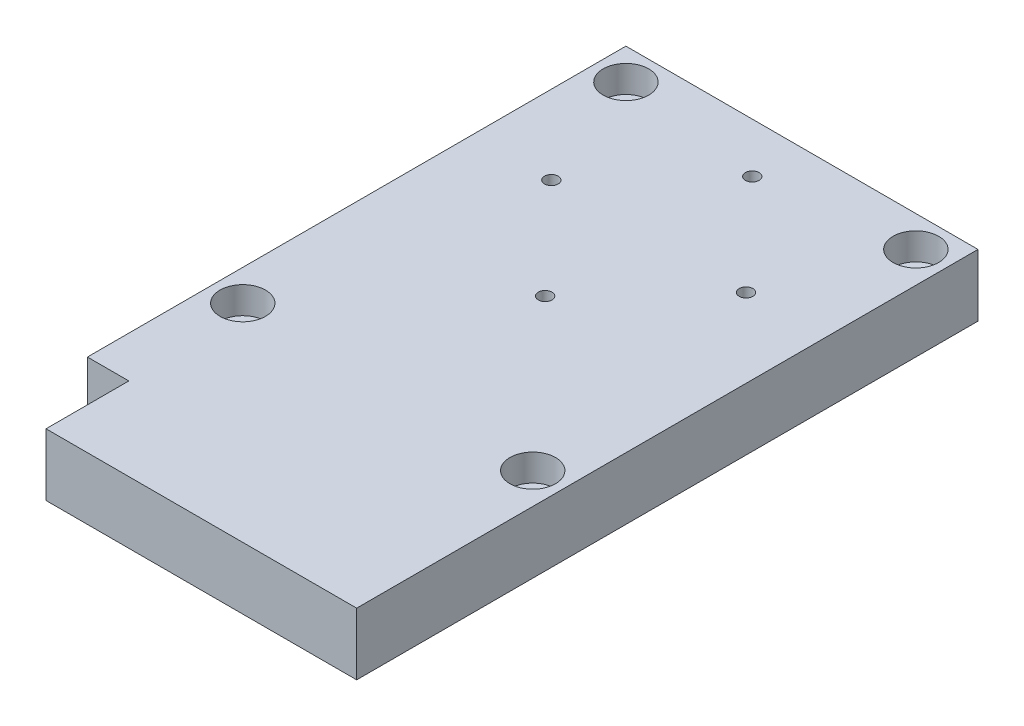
ISO-10303-21;
HEADER;
FILE_DESCRIPTION(('STEP AP214'),'2;1');
FILE_NAME('part.step','',(''),(''),'','','');
FILE_SCHEMA(('AUTOMOTIVE_DESIGN { 1 0 10303 214 1 1 1 1 }'));
ENDSEC;
DATA;
#1=APPLICATION_CONTEXT('core data for automotive mechanical design processes');
#2=APPLICATION_PROTOCOL_DEFINITION('international standard','automotive_design',2000,#1);
#3=PRODUCT_CONTEXT('',#1,'mechanical');
#4=PRODUCT('Part','Part','',(#3));
#5=PRODUCT_RELATED_PRODUCT_CATEGORY('part','',(#4));
#6=PRODUCT_DEFINITION_FORMATION('','',#4);
#7=PRODUCT_DEFINITION_CONTEXT('part definition',#1,'design');
#8=PRODUCT_DEFINITION('design','',#6,#7);
#9=PRODUCT_DEFINITION_SHAPE('','',#8);
#10=(LENGTH_UNIT() NAMED_UNIT(*) SI_UNIT(.MILLI.,.METRE.));
#11=(NAMED_UNIT(*) PLANE_ANGLE_UNIT() SI_UNIT($,.RADIAN.));
#12=(NAMED_UNIT(*) SI_UNIT($,.STERADIAN.) SOLID_ANGLE_UNIT());
#13=UNCERTAINTY_MEASURE_WITH_UNIT(LENGTH_MEASURE(1.E-05),#10,'distance_accuracy_value','');
#14=(GEOMETRIC_REPRESENTATION_CONTEXT(3) GLOBAL_UNCERTAINTY_ASSIGNED_CONTEXT((#13)) GLOBAL_UNIT_ASSIGNED_CONTEXT((#10,
#11,#12)) REPRESENTATION_CONTEXT('',''));
#15=CARTESIAN_POINT('',(0.,0.,0.));
#16=DIRECTION('',(0.,0.,1.));
#17=DIRECTION('',(1.,0.,0.));
#18=AXIS2_PLACEMENT_3D('',#15,#16,#17);
#19=CARTESIAN_POINT('',(7.5,-135.,100.));
#20=DIRECTION('',(0.,1.,0.));
#21=DIRECTION('',(0.,0.,1.));
#22=AXIS2_PLACEMENT_3D('',#19,#20,#21);
#23=CYLINDRICAL_SURFACE('',#22,3.25);
#24=CARTESIAN_POINT('',(7.5,1.11022302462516E-13,100.));
#25=DIRECTION('',(0.,1.,0.));
#26=DIRECTION('',(0.,0.,1.));
#27=AXIS2_PLACEMENT_3D('',#24,#25,#26);
#28=CIRCLE('',#27,3.25);
#29=CARTESIAN_POINT('',(7.5,1.11022302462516E-13,103.25));
#30=VERTEX_POINT('',#29);
#31=EDGE_CURVE('E171',#30,#30,#28,.T.);
#32=ORIENTED_EDGE('',*,*,#31,.F.);
#33=EDGE_LOOP('',(#32));
#34=FACE_BOUND('',#33,.T.);
#35=CARTESIAN_POINT('',(7.5,8.50000000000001,100.));
#36=DIRECTION('',(0.,1.,0.));
#37=DIRECTION('',(0.,0.,1.));
#38=AXIS2_PLACEMENT_3D('',#35,#36,#37);
#39=CIRCLE('',#38,3.25);
#40=CARTESIAN_POINT('',(7.5,8.50000000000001,103.25));
#41=VERTEX_POINT('',#40);
#42=EDGE_CURVE('E36',#41,#41,#39,.F.);
#43=ORIENTED_EDGE('',*,*,#42,.F.);
#44=EDGE_LOOP('',(#43));
#45=FACE_BOUND('',#44,.T.);
#46=ADVANCED_FACE('F32',(#34,#45),#23,.F.);
#47=CARTESIAN_POINT('',(77.5,-135.,100.));
#48=DIRECTION('',(0.,1.,0.));
#49=DIRECTION('',(0.,0.,1.));
#50=AXIS2_PLACEMENT_3D('',#47,#48,#49);
#51=CYLINDRICAL_SURFACE('',#50,3.25);
#52=CARTESIAN_POINT('',(77.5,1.11022302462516E-13,100.));
#53=DIRECTION('',(0.,1.,0.));
#54=DIRECTION('',(0.,0.,1.));
#55=AXIS2_PLACEMENT_3D('',#52,#53,#54);
#56=CIRCLE('',#55,3.25);
#57=CARTESIAN_POINT('',(77.5,1.11022302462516E-13,103.25));
#58=VERTEX_POINT('',#57);
#59=EDGE_CURVE('E174',#58,#58,#56,.T.);
#60=ORIENTED_EDGE('',*,*,#59,.F.);
#61=EDGE_LOOP('',(#60));
#62=FACE_BOUND('',#61,.T.);
#63=CARTESIAN_POINT('',(77.5,8.50000000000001,100.));
#64=DIRECTION('',(0.,1.,0.));
#65=DIRECTION('',(0.,0.,1.));
#66=AXIS2_PLACEMENT_3D('',#63,#64,#65);
#67=CIRCLE('',#66,3.25);
#68=CARTESIAN_POINT('',(77.5,8.50000000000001,103.25));
#69=VERTEX_POINT('',#68);
#70=EDGE_CURVE('E123',#69,#69,#67,.F.);
#71=ORIENTED_EDGE('',*,*,#70,.F.);
#72=EDGE_LOOP('',(#71));
#73=FACE_BOUND('',#72,.T.);
#74=ADVANCED_FACE('F225',(#62,#73),#51,.F.);
#75=CARTESIAN_POINT('',(77.5,-135.,7.5));
#76=DIRECTION('',(0.,1.,0.));
#77=DIRECTION('',(0.,0.,1.));
#78=AXIS2_PLACEMENT_3D('',#75,#76,#77);
#79=CYLINDRICAL_SURFACE('',#78,3.25);
#80=CARTESIAN_POINT('',(77.5,1.11022302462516E-13,7.5));
#81=DIRECTION('',(0.,1.,0.));
#82=DIRECTION('',(0.,0.,1.));
#83=AXIS2_PLACEMENT_3D('',#80,#81,#82);
#84=CIRCLE('',#83,3.25);
#85=CARTESIAN_POINT('',(77.5,1.11022302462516E-13,10.75));
#86=VERTEX_POINT('',#85);
#87=EDGE_CURVE('E177',#86,#86,#84,.T.);
#88=ORIENTED_EDGE('',*,*,#87,.F.);
#89=EDGE_LOOP('',(#88));
#90=FACE_BOUND('',#89,.T.);
#91=CARTESIAN_POINT('',(77.5,8.50000000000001,7.5));
#92=DIRECTION('',(0.,1.,0.));
#93=DIRECTION('',(0.,0.,1.));
#94=AXIS2_PLACEMENT_3D('',#91,#92,#93);
#95=CIRCLE('',#94,3.25);
#96=CARTESIAN_POINT('',(77.5,8.50000000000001,10.75));
#97=VERTEX_POINT('',#96);
#98=EDGE_CURVE('E119',#97,#97,#95,.F.);
#99=ORIENTED_EDGE('',*,*,#98,.F.);
#100=EDGE_LOOP('',(#99));
#101=FACE_BOUND('',#100,.T.);
#102=ADVANCED_FACE('F231',(#90,#101),#79,.F.);
#103=CARTESIAN_POINT('',(7.5,-135.,7.5));
#104=DIRECTION('',(0.,1.,0.));
#105=DIRECTION('',(0.,0.,1.));
#106=AXIS2_PLACEMENT_3D('',#103,#104,#105);
#107=CYLINDRICAL_SURFACE('',#106,3.25);
#108=CARTESIAN_POINT('',(7.5,1.11022302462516E-13,7.5));
#109=DIRECTION('',(0.,1.,0.));
#110=DIRECTION('',(0.,0.,1.));
#111=AXIS2_PLACEMENT_3D('',#108,#109,#110);
#112=CIRCLE('',#111,3.25);
#113=CARTESIAN_POINT('',(7.5,1.11022302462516E-13,10.75));
#114=VERTEX_POINT('',#113);
#115=EDGE_CURVE('E180',#114,#114,#112,.T.);
#116=ORIENTED_EDGE('',*,*,#115,.F.);
#117=EDGE_LOOP('',(#116));
#118=FACE_BOUND('',#117,.T.);
#119=CARTESIAN_POINT('',(7.5,8.50000000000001,7.5));
#120=DIRECTION('',(0.,1.,0.));
#121=DIRECTION('',(0.,0.,1.));
#122=AXIS2_PLACEMENT_3D('',#119,#120,#121);
#123=CIRCLE('',#122,3.25);
#124=CARTESIAN_POINT('',(7.5,8.50000000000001,10.75));
#125=VERTEX_POINT('',#124);
#126=EDGE_CURVE('E114',#125,#125,#123,.F.);
#127=ORIENTED_EDGE('',*,*,#126,.F.);
#128=EDGE_LOOP('',(#127));
#129=FACE_BOUND('',#128,.T.);
#130=ADVANCED_FACE('F240',(#118,#129),#107,.F.);
#131=CARTESIAN_POINT('',(0.,1.13686837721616E-13,150.));
#132=DIRECTION('',(0.,1.,0.));
#133=DIRECTION('',(0.,0.,1.));
#134=AXIS2_PLACEMENT_3D('',#131,#132,#133);
#135=PLANE('',#134);
#136=CARTESIAN_POINT('',(42.5,1.11022302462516E-13,12.0000000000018));
#137=DIRECTION('',(0.,1.,0.));
#138=DIRECTION('',(0.,0.,1.));
#139=AXIS2_PLACEMENT_3D('',#136,#137,#138);
#140=CIRCLE('',#139,1.65);
#141=CARTESIAN_POINT('',(42.5,1.11022302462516E-13,13.6500000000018));
#142=VERTEX_POINT('',#141);
#143=EDGE_CURVE('E150',#142,#142,#140,.T.);
#144=ORIENTED_EDGE('',*,*,#143,.T.);
#145=EDGE_LOOP('',(#144));
#146=FACE_BOUND('',#145,.T.);
#147=CARTESIAN_POINT('',(42.5,1.11022302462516E-13,62.0000000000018));
#148=DIRECTION('',(0.,1.,0.));
#149=DIRECTION('',(0.,0.,1.));
#150=AXIS2_PLACEMENT_3D('',#147,#148,#149);
#151=CIRCLE('',#150,1.65);
#152=CARTESIAN_POINT('',(42.5,1.11022302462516E-13,63.6500000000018));
#153=VERTEX_POINT('',#152);
#154=EDGE_CURVE('E156',#153,#153,#151,.T.);
#155=ORIENTED_EDGE('',*,*,#154,.T.);
#156=EDGE_LOOP('',(#155));
#157=FACE_BOUND('',#156,.T.);
#158=CARTESIAN_POINT('',(66.,1.11022302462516E-13,37.0000000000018));
#159=DIRECTION('',(0.,1.,0.));
#160=DIRECTION('',(0.,0.,1.));
#161=AXIS2_PLACEMENT_3D('',#158,#159,#160);
#162=CIRCLE('',#161,1.65);
#163=CARTESIAN_POINT('',(66.,1.11022302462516E-13,38.6500000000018));
#164=VERTEX_POINT('',#163);
#165=EDGE_CURVE('E162',#164,#164,#162,.T.);
#166=ORIENTED_EDGE('',*,*,#165,.T.);
#167=EDGE_LOOP('',(#166));
#168=FACE_BOUND('',#167,.T.);
#169=CARTESIAN_POINT('',(19.,1.11022302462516E-13,37.0000000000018));
#170=DIRECTION('',(0.,1.,0.));
#171=DIRECTION('',(0.,0.,1.));
#172=AXIS2_PLACEMENT_3D('',#169,#170,#171);
#173=CIRCLE('',#172,1.65);
#174=CARTESIAN_POINT('',(19.,1.11022302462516E-13,38.6500000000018));
#175=VERTEX_POINT('',#174);
#176=EDGE_CURVE('E168',#175,#175,#173,.T.);
#177=ORIENTED_EDGE('',*,*,#176,.T.);
#178=EDGE_LOOP('',(#177));
#179=FACE_BOUND('',#178,.T.);
#180=ORIENTED_EDGE('',*,*,#31,.T.);
#181=EDGE_LOOP('',(#180));
#182=FACE_BOUND('',#181,.T.);
#183=ORIENTED_EDGE('',*,*,#59,.T.);
#184=EDGE_LOOP('',(#183));
#185=FACE_BOUND('',#184,.T.);
#186=ORIENTED_EDGE('',*,*,#87,.T.);
#187=EDGE_LOOP('',(#186));
#188=FACE_BOUND('',#187,.T.);
#189=ORIENTED_EDGE('',*,*,#115,.T.);
#190=EDGE_LOOP('',(#189));
#191=FACE_BOUND('',#190,.T.);
#192=DIRECTION('',(0.,0.,-1.));
#193=VECTOR('',#192,1.);
#194=CARTESIAN_POINT('',(10.,1.13686837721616E-13,150.));
#195=LINE('',#194,#193);
#196=CARTESIAN_POINT('',(9.99999999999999,1.13686837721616E-13,150.));
#197=VERTEX_POINT('',#196);
#198=CARTESIAN_POINT('',(10.,1.11022302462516E-13,130.));
#199=VERTEX_POINT('',#198);
#200=EDGE_CURVE('E48',#197,#199,#195,.T.);
#201=ORIENTED_EDGE('',*,*,#200,.T.);
#202=DIRECTION('',(-1.,0.,0.));
#203=VECTOR('',#202,1.);
#204=CARTESIAN_POINT('',(0.,1.13686837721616E-13,130.));
#205=LINE('',#204,#203);
#206=CARTESIAN_POINT('',(0.,1.11022302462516E-13,130.));
#207=VERTEX_POINT('',#206);
#208=EDGE_CURVE('E83',#199,#207,#205,.T.);
#209=ORIENTED_EDGE('',*,*,#208,.T.);
#210=DIRECTION('',(0.,0.,-1.));
#211=VECTOR('',#210,1.);
#212=CARTESIAN_POINT('',(0.,1.13686837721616E-13,150.));
#213=LINE('',#212,#211);
#214=CARTESIAN_POINT('',(0.,1.13686837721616E-13,0.));
#215=VERTEX_POINT('',#214);
#216=EDGE_CURVE('E77',#207,#215,#213,.T.);
#217=ORIENTED_EDGE('',*,*,#216,.T.);
#218=DIRECTION('',(1.,0.,0.));
#219=VECTOR('',#218,1.);
#220=CARTESIAN_POINT('',(0.,1.13686837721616E-13,0.));
#221=LINE('',#220,#219);
#222=CARTESIAN_POINT('',(85.,1.13686837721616E-13,0.));
#223=VERTEX_POINT('',#222);
#224=EDGE_CURVE('E81',#215,#223,#221,.T.);
#225=ORIENTED_EDGE('',*,*,#224,.T.);
#226=DIRECTION('',(0.,0.,-1.));
#227=VECTOR('',#226,1.);
#228=CARTESIAN_POINT('',(85.,1.13686837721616E-13,150.));
#229=LINE('',#228,#227);
#230=CARTESIAN_POINT('',(85.,1.13686837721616E-13,150.));
#231=VERTEX_POINT('',#230);
#232=EDGE_CURVE('E41',#231,#223,#229,.T.);
#233=ORIENTED_EDGE('',*,*,#232,.F.);
#234=DIRECTION('',(1.,0.,0.));
#235=VECTOR('',#234,1.);
#236=CARTESIAN_POINT('',(0.,1.13686837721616E-13,150.));
#237=LINE('',#236,#235);
#238=EDGE_CURVE('E96',#197,#231,#237,.T.);
#239=ORIENTED_EDGE('',*,*,#238,.F.);
#240=EDGE_LOOP('',(#201,#209,#217,#225,#233,#239));
#241=FACE_BOUND('',#240,.T.);
#242=ADVANCED_FACE('F34',(#146,#157,#168,#179,#182,#185,#188,#191,#241),#135,.F.);
#243=CARTESIAN_POINT('',(85.,1.13686837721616E-13,150.));
#244=DIRECTION('',(-1.,0.,0.));
#245=DIRECTION('',(0.,0.,1.));
#246=AXIS2_PLACEMENT_3D('',#243,#244,#245);
#247=PLANE('',#246);
#248=DIRECTION('',(0.,1.,0.));
#249=VECTOR('',#248,1.);
#250=CARTESIAN_POINT('',(85.,1.13686837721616E-13,0.));
#251=LINE('',#250,#249);
#252=CARTESIAN_POINT('',(85.,15.,0.));
#253=VERTEX_POINT('',#252);
#254=EDGE_CURVE('E100',#223,#253,#251,.T.);
#255=ORIENTED_EDGE('',*,*,#254,.T.);
#256=DIRECTION('',(0.,0.,-1.));
#257=VECTOR('',#256,1.);
#258=CARTESIAN_POINT('',(85.,15.,150.));
#259=LINE('',#258,#257);
#260=CARTESIAN_POINT('',(85.,15.,150.));
#261=VERTEX_POINT('',#260);
#262=EDGE_CURVE('E110',#261,#253,#259,.T.);
#263=ORIENTED_EDGE('',*,*,#262,.F.);
#264=DIRECTION('',(0.,1.,0.));
#265=VECTOR('',#264,1.);
#266=CARTESIAN_POINT('',(85.,1.13686837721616E-13,150.));
#267=LINE('',#266,#265);
#268=EDGE_CURVE('E57',#231,#261,#267,.T.);
#269=ORIENTED_EDGE('',*,*,#268,.F.);
#270=ORIENTED_EDGE('',*,*,#232,.T.);
#271=EDGE_LOOP('',(#255,#263,#269,#270));
#272=FACE_BOUND('',#271,.T.);
#273=ADVANCED_FACE('F247',(#272),#247,.F.);
#274=CARTESIAN_POINT('',(0.,15.,150.));
#275=DIRECTION('',(0.,-1.,0.));
#276=DIRECTION('',(0.,0.,-1.));
#277=AXIS2_PLACEMENT_3D('',#274,#275,#276);
#278=PLANE('',#277);
#279=CARTESIAN_POINT('',(7.5,15.,100.));
#280=DIRECTION('',(0.,1.,0.));
#281=DIRECTION('',(0.,0.,1.));
#282=AXIS2_PLACEMENT_3D('',#279,#280,#281);
#283=CIRCLE('',#282,5.5);
#284=CARTESIAN_POINT('',(7.5,15.,105.5));
#285=VERTEX_POINT('',#284);
#286=EDGE_CURVE('E139',#285,#285,#283,.T.);
#287=ORIENTED_EDGE('',*,*,#286,.F.);
#288=EDGE_LOOP('',(#287));
#289=FACE_BOUND('',#288,.T.);
#290=CARTESIAN_POINT('',(77.5,15.,100.));
#291=DIRECTION('',(0.,1.,0.));
#292=DIRECTION('',(0.,0.,1.));
#293=AXIS2_PLACEMENT_3D('',#290,#291,#292);
#294=CIRCLE('',#293,5.50000000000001);
#295=CARTESIAN_POINT('',(77.5,15.,105.5));
#296=VERTEX_POINT('',#295);
#297=EDGE_CURVE('E132',#296,#296,#294,.T.);
#298=ORIENTED_EDGE('',*,*,#297,.F.);
#299=EDGE_LOOP('',(#298));
#300=FACE_BOUND('',#299,.T.);
#301=CARTESIAN_POINT('',(77.5,15.,7.5));
#302=DIRECTION('',(0.,1.,0.));
#303=DIRECTION('',(0.,0.,1.));
#304=AXIS2_PLACEMENT_3D('',#301,#302,#303);
#305=CIRCLE('',#304,5.50000000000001);
#306=CARTESIAN_POINT('',(77.5,15.,13.));
#307=VERTEX_POINT('',#306);
#308=EDGE_CURVE('E125',#307,#307,#305,.T.);
#309=ORIENTED_EDGE('',*,*,#308,.F.);
#310=EDGE_LOOP('',(#309));
#311=FACE_BOUND('',#310,.T.);
#312=CARTESIAN_POINT('',(7.5,15.,7.5));
#313=DIRECTION('',(0.,1.,0.));
#314=DIRECTION('',(0.,0.,1.));
#315=AXIS2_PLACEMENT_3D('',#312,#313,#314);
#316=CIRCLE('',#315,5.5);
#317=CARTESIAN_POINT('',(7.5,15.,13.));
#318=VERTEX_POINT('',#317);
#319=EDGE_CURVE('E121',#318,#318,#316,.T.);
#320=ORIENTED_EDGE('',*,*,#319,.F.);
#321=EDGE_LOOP('',(#320));
#322=FACE_BOUND('',#321,.T.);
#323=CARTESIAN_POINT('',(42.5,15.,12.0000000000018));
#324=DIRECTION('',(0.,1.,0.));
#325=DIRECTION('',(0.,0.,1.));
#326=AXIS2_PLACEMENT_3D('',#323,#324,#325);
#327=CIRCLE('',#326,1.65);
#328=CARTESIAN_POINT('',(42.5,15.,13.6500000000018));
#329=VERTEX_POINT('',#328);
#330=EDGE_CURVE('E117',#329,#329,#327,.T.);
#331=ORIENTED_EDGE('',*,*,#330,.F.);
#332=EDGE_LOOP('',(#331));
#333=FACE_BOUND('',#332,.T.);
#334=CARTESIAN_POINT('',(42.5,15.,62.0000000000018));
#335=DIRECTION('',(0.,1.,0.));
#336=DIRECTION('',(0.,0.,1.));
#337=AXIS2_PLACEMENT_3D('',#334,#335,#336);
#338=CIRCLE('',#337,1.65);
#339=CARTESIAN_POINT('',(42.5,15.,63.6500000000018));
#340=VERTEX_POINT('',#339);
#341=EDGE_CURVE('E153',#340,#340,#338,.T.);
#342=ORIENTED_EDGE('',*,*,#341,.F.);
#343=EDGE_LOOP('',(#342));
#344=FACE_BOUND('',#343,.T.);
#345=CARTESIAN_POINT('',(66.,15.,37.0000000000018));
#346=DIRECTION('',(0.,1.,0.));
#347=DIRECTION('',(0.,0.,1.));
#348=AXIS2_PLACEMENT_3D('',#345,#346,#347);
#349=CIRCLE('',#348,1.65);
#350=CARTESIAN_POINT('',(66.,15.,38.6500000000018));
#351=VERTEX_POINT('',#350);
#352=EDGE_CURVE('E159',#351,#351,#349,.T.);
#353=ORIENTED_EDGE('',*,*,#352,.F.);
#354=EDGE_LOOP('',(#353));
#355=FACE_BOUND('',#354,.T.);
#356=CARTESIAN_POINT('',(19.,15.,37.0000000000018));
#357=DIRECTION('',(0.,1.,0.));
#358=DIRECTION('',(0.,0.,1.));
#359=AXIS2_PLACEMENT_3D('',#356,#357,#358);
#360=CIRCLE('',#359,1.65);
#361=CARTESIAN_POINT('',(19.,15.,38.6500000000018));
#362=VERTEX_POINT('',#361);
#363=EDGE_CURVE('E165',#362,#362,#360,.T.);
#364=ORIENTED_EDGE('',*,*,#363,.F.);
#365=EDGE_LOOP('',(#364));
#366=FACE_BOUND('',#365,.T.);
#367=DIRECTION('',(0.,0.,-1.));
#368=VECTOR('',#367,1.);
#369=CARTESIAN_POINT('',(0.,15.,150.));
#370=LINE('',#369,#368);
#371=CARTESIAN_POINT('',(0.,15.,130.));
#372=VERTEX_POINT('',#371);
#373=CARTESIAN_POINT('',(0.,15.,0.));
#374=VERTEX_POINT('',#373);
#375=EDGE_CURVE('E86',#372,#374,#370,.T.);
#376=ORIENTED_EDGE('',*,*,#375,.F.);
#377=DIRECTION('',(-1.,0.,0.));
#378=VECTOR('',#377,1.);
#379=CARTESIAN_POINT('',(0.,15.,130.));
#380=LINE('',#379,#378);
#381=CARTESIAN_POINT('',(10.,15.,130.));
#382=VERTEX_POINT('',#381);
#383=EDGE_CURVE('E186',#382,#372,#380,.T.);
#384=ORIENTED_EDGE('',*,*,#383,.F.);
#385=DIRECTION('',(0.,0.,-1.));
#386=VECTOR('',#385,1.);
#387=CARTESIAN_POINT('',(10.,15.,150.));
#388=LINE('',#387,#386);
#389=CARTESIAN_POINT('',(10.,15.,150.));
#390=VERTEX_POINT('',#389);
#391=EDGE_CURVE('E183',#390,#382,#388,.T.);
#392=ORIENTED_EDGE('',*,*,#391,.F.);
#393=DIRECTION('',(-1.,0.,0.));
#394=VECTOR('',#393,1.);
#395=CARTESIAN_POINT('',(0.,15.,150.));
#396=LINE('',#395,#394);
#397=EDGE_CURVE('E87',#261,#390,#396,.T.);
#398=ORIENTED_EDGE('',*,*,#397,.F.);
#399=ORIENTED_EDGE('',*,*,#262,.T.);
#400=DIRECTION('',(-1.,0.,0.));
#401=VECTOR('',#400,1.);
#402=CARTESIAN_POINT('',(0.,15.,0.));
#403=LINE('',#402,#401);
#404=EDGE_CURVE('E97',#253,#374,#403,.T.);
#405=ORIENTED_EDGE('',*,*,#404,.T.);
#406=EDGE_LOOP('',(#376,#384,#392,#398,#399,#405));
#407=FACE_BOUND('',#406,.T.);
#408=ADVANCED_FACE('F203',(#289,#300,#311,#322,#333,#344,#355,#366,#407),#278,.F.);
#409=CARTESIAN_POINT('',(0.,1.13686837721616E-13,150.));
#410=DIRECTION('',(1.,0.,0.));
#411=DIRECTION('',(0.,0.,-1.));
#412=AXIS2_PLACEMENT_3D('',#409,#410,#411);
#413=PLANE('',#412);
#414=ORIENTED_EDGE('',*,*,#216,.F.);
#415=DIRECTION('',(0.,1.,0.));
#416=VECTOR('',#415,1.);
#417=CARTESIAN_POINT('',(0.,-135.,130.));
#418=LINE('',#417,#416);
#419=EDGE_CURVE('E190',#207,#372,#418,.T.);
#420=ORIENTED_EDGE('',*,*,#419,.T.);
#421=ORIENTED_EDGE('',*,*,#375,.T.);
#422=DIRECTION('',(0.,-1.,0.));
#423=VECTOR('',#422,1.);
#424=CARTESIAN_POINT('',(0.,1.13686837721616E-13,0.));
#425=LINE('',#424,#423);
#426=EDGE_CURVE('E90',#374,#215,#425,.T.);
#427=ORIENTED_EDGE('',*,*,#426,.T.);
#428=EDGE_LOOP('',(#414,#420,#421,#427));
#429=FACE_BOUND('',#428,.T.);
#430=ADVANCED_FACE('F91',(#429),#413,.F.);
#431=CARTESIAN_POINT('',(85.,1.13686837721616E-13,150.));
#432=DIRECTION('',(0.,0.,1.));
#433=DIRECTION('',(1.,0.,0.));
#434=AXIS2_PLACEMENT_3D('',#431,#432,#433);
#435=PLANE('',#434);
#436=DIRECTION('',(0.,1.,0.));
#437=VECTOR('',#436,1.);
#438=CARTESIAN_POINT('',(9.99999999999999,1.13686837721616E-13,150.));
#439=LINE('',#438,#437);
#440=EDGE_CURVE('E11',#197,#390,#439,.T.);
#441=ORIENTED_EDGE('',*,*,#440,.F.);
#442=ORIENTED_EDGE('',*,*,#238,.T.);
#443=ORIENTED_EDGE('',*,*,#268,.T.);
#444=ORIENTED_EDGE('',*,*,#397,.T.);
#445=EDGE_LOOP('',(#441,#442,#443,#444));
#446=FACE_BOUND('',#445,.T.);
#447=ADVANCED_FACE('F197',(#446),#435,.T.);
#448=CARTESIAN_POINT('',(85.,1.13686837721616E-13,0.));
#449=DIRECTION('',(0.,0.,1.));
#450=DIRECTION('',(1.,0.,0.));
#451=AXIS2_PLACEMENT_3D('',#448,#449,#450);
#452=PLANE('',#451);
#453=ORIENTED_EDGE('',*,*,#224,.F.);
#454=ORIENTED_EDGE('',*,*,#426,.F.);
#455=ORIENTED_EDGE('',*,*,#404,.F.);
#456=ORIENTED_EDGE('',*,*,#254,.F.);
#457=EDGE_LOOP('',(#453,#454,#455,#456));
#458=FACE_BOUND('',#457,.T.);
#459=ADVANCED_FACE('F99',(#458),#452,.F.);
#460=CARTESIAN_POINT('',(0.,-135.,130.));
#461=DIRECTION('',(0.,0.,-1.));
#462=DIRECTION('',(-1.,0.,0.));
#463=AXIS2_PLACEMENT_3D('',#460,#461,#462);
#464=PLANE('',#463);
#465=DIRECTION('',(0.,1.,0.));
#466=VECTOR('',#465,1.);
#467=CARTESIAN_POINT('',(10.,-135.,130.));
#468=LINE('',#467,#466);
#469=EDGE_CURVE('E189',#199,#382,#468,.T.);
#470=ORIENTED_EDGE('',*,*,#469,.T.);
#471=ORIENTED_EDGE('',*,*,#383,.T.);
#472=ORIENTED_EDGE('',*,*,#419,.F.);
#473=ORIENTED_EDGE('',*,*,#208,.F.);
#474=EDGE_LOOP('',(#470,#471,#472,#473));
#475=FACE_BOUND('',#474,.T.);
#476=ADVANCED_FACE('F213',(#475),#464,.F.);
#477=CARTESIAN_POINT('',(10.,-135.,150.));
#478=DIRECTION('',(1.,0.,0.));
#479=DIRECTION('',(0.,0.,-1.));
#480=AXIS2_PLACEMENT_3D('',#477,#478,#479);
#481=PLANE('',#480);
#482=ORIENTED_EDGE('',*,*,#440,.T.);
#483=ORIENTED_EDGE('',*,*,#391,.T.);
#484=ORIENTED_EDGE('',*,*,#469,.F.);
#485=ORIENTED_EDGE('',*,*,#200,.F.);
#486=EDGE_LOOP('',(#482,#483,#484,#485));
#487=FACE_BOUND('',#486,.T.);
#488=ADVANCED_FACE('F205',(#487),#481,.F.);
#489=CARTESIAN_POINT('',(19.,-135.,37.0000000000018));
#490=DIRECTION('',(0.,1.,0.));
#491=DIRECTION('',(0.,0.,1.));
#492=AXIS2_PLACEMENT_3D('',#489,#490,#491);
#493=CYLINDRICAL_SURFACE('',#492,1.65);
#494=ORIENTED_EDGE('',*,*,#363,.T.);
#495=EDGE_LOOP('',(#494));
#496=FACE_BOUND('',#495,.T.);
#497=ORIENTED_EDGE('',*,*,#176,.F.);
#498=EDGE_LOOP('',(#497));
#499=FACE_BOUND('',#498,.T.);
#500=ADVANCED_FACE('F220',(#496,#499),#493,.F.);
#501=CARTESIAN_POINT('',(66.,-135.,37.0000000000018));
#502=DIRECTION('',(0.,1.,0.));
#503=DIRECTION('',(0.,0.,1.));
#504=AXIS2_PLACEMENT_3D('',#501,#502,#503);
#505=CYLINDRICAL_SURFACE('',#504,1.65);
#506=ORIENTED_EDGE('',*,*,#352,.T.);
#507=EDGE_LOOP('',(#506));
#508=FACE_BOUND('',#507,.T.);
#509=ORIENTED_EDGE('',*,*,#165,.F.);
#510=EDGE_LOOP('',(#509));
#511=FACE_BOUND('',#510,.T.);
#512=ADVANCED_FACE('F274',(#508,#511),#505,.F.);
#513=CARTESIAN_POINT('',(42.5,-135.,62.0000000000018));
#514=DIRECTION('',(0.,1.,0.));
#515=DIRECTION('',(0.,0.,1.));
#516=AXIS2_PLACEMENT_3D('',#513,#514,#515);
#517=CYLINDRICAL_SURFACE('',#516,1.65);
#518=ORIENTED_EDGE('',*,*,#341,.T.);
#519=EDGE_LOOP('',(#518));
#520=FACE_BOUND('',#519,.T.);
#521=ORIENTED_EDGE('',*,*,#154,.F.);
#522=EDGE_LOOP('',(#521));
#523=FACE_BOUND('',#522,.T.);
#524=ADVANCED_FACE('F266',(#520,#523),#517,.F.);
#525=CARTESIAN_POINT('',(42.5,-135.,12.0000000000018));
#526=DIRECTION('',(0.,1.,0.));
#527=DIRECTION('',(0.,0.,1.));
#528=AXIS2_PLACEMENT_3D('',#525,#526,#527);
#529=CYLINDRICAL_SURFACE('',#528,1.65);
#530=ORIENTED_EDGE('',*,*,#330,.T.);
#531=EDGE_LOOP('',(#530));
#532=FACE_BOUND('',#531,.T.);
#533=ORIENTED_EDGE('',*,*,#143,.F.);
#534=EDGE_LOOP('',(#533));
#535=FACE_BOUND('',#534,.T.);
#536=ADVANCED_FACE('F256',(#532,#535),#529,.F.);
#537=CARTESIAN_POINT('',(7.5,8.5,7.5));
#538=DIRECTION('',(0.,1.,0.));
#539=DIRECTION('',(0.,0.,1.));
#540=AXIS2_PLACEMENT_3D('',#537,#538,#539);
#541=PLANE('',#540);
#542=CARTESIAN_POINT('',(7.5,8.5,7.5));
#543=DIRECTION('',(0.,1.,0.));
#544=DIRECTION('',(0.,0.,1.));
#545=AXIS2_PLACEMENT_3D('',#542,#543,#544);
#546=CIRCLE('',#545,5.5);
#547=CARTESIAN_POINT('',(7.5,8.5,13.));
#548=VERTEX_POINT('',#547);
#549=EDGE_CURVE('E118',#548,#548,#546,.T.);
#550=ORIENTED_EDGE('',*,*,#549,.T.);
#551=EDGE_LOOP('',(#550));
#552=FACE_BOUND('',#551,.T.);
#553=ORIENTED_EDGE('',*,*,#126,.T.);
#554=EDGE_LOOP('',(#553));
#555=FACE_BOUND('',#554,.T.);
#556=ADVANCED_FACE('F253',(#552,#555),#541,.T.);
#557=CARTESIAN_POINT('',(7.5,8.5,7.5));
#558=DIRECTION('',(0.,1.,0.));
#559=DIRECTION('',(0.,0.,1.));
#560=AXIS2_PLACEMENT_3D('',#557,#558,#559);
#561=CYLINDRICAL_SURFACE('',#560,5.5);
#562=CARTESIAN_POINT('',(7.5,8.5,13.));
#563=CARTESIAN_POINT('',(7.5,8.56770833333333,13.));
#564=CARTESIAN_POINT('',(7.5,8.63541666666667,13.));
#565=CARTESIAN_POINT('',(7.5,8.77083333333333,13.));
#566=CARTESIAN_POINT('',(7.5,8.83854166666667,13.));
#567=CARTESIAN_POINT('',(7.5,8.97395833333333,13.));
#568=CARTESIAN_POINT('',(7.5,9.04166666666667,13.));
#569=CARTESIAN_POINT('',(7.5,9.17708333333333,13.));
#570=CARTESIAN_POINT('',(7.5,9.24479166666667,13.));
#571=CARTESIAN_POINT('',(7.5,9.38020833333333,13.));
#572=CARTESIAN_POINT('',(7.5,9.44791666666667,13.));
#573=CARTESIAN_POINT('',(7.5,9.58333333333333,13.));
#574=CARTESIAN_POINT('',(7.5,9.65104166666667,13.));
#575=CARTESIAN_POINT('',(7.5,9.78645833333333,13.));
#576=CARTESIAN_POINT('',(7.5,9.85416666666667,13.));
#577=CARTESIAN_POINT('',(7.5,9.98958333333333,13.));
#578=CARTESIAN_POINT('',(7.5,10.0572916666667,13.));
#579=CARTESIAN_POINT('',(7.5,10.1927083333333,13.));
#580=CARTESIAN_POINT('',(7.5,10.2604166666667,13.));
#581=CARTESIAN_POINT('',(7.5,10.3958333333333,13.));
#582=CARTESIAN_POINT('',(7.5,10.4635416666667,13.));
#583=CARTESIAN_POINT('',(7.5,10.5989583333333,13.));
#584=CARTESIAN_POINT('',(7.5,10.6666666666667,13.));
#585=CARTESIAN_POINT('',(7.5,10.8020833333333,13.));
#586=CARTESIAN_POINT('',(7.5,10.8697916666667,13.));
#587=CARTESIAN_POINT('',(7.5,11.0052083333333,13.));
#588=CARTESIAN_POINT('',(7.5,11.0729166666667,13.));
#589=CARTESIAN_POINT('',(7.5,11.2083333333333,13.));
#590=CARTESIAN_POINT('',(7.5,11.2760416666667,13.));
#591=CARTESIAN_POINT('',(7.5,11.4114583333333,13.));
#592=CARTESIAN_POINT('',(7.5,11.4791666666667,13.));
#593=CARTESIAN_POINT('',(7.5,11.6145833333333,13.));
#594=CARTESIAN_POINT('',(7.5,11.6822916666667,13.));
#595=CARTESIAN_POINT('',(7.5,11.8177083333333,13.));
#596=CARTESIAN_POINT('',(7.5,11.8854166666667,13.));
#597=CARTESIAN_POINT('',(7.5,12.0208333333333,13.));
#598=CARTESIAN_POINT('',(7.5,12.0885416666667,13.));
#599=CARTESIAN_POINT('',(7.5,12.2239583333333,13.));
#600=CARTESIAN_POINT('',(7.5,12.2916666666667,13.));
#601=CARTESIAN_POINT('',(7.5,12.4270833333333,13.));
#602=CARTESIAN_POINT('',(7.5,12.4947916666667,13.));
#603=CARTESIAN_POINT('',(7.5,12.6302083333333,13.));
#604=CARTESIAN_POINT('',(7.5,12.6979166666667,13.));
#605=CARTESIAN_POINT('',(7.5,12.8333333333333,13.));
#606=CARTESIAN_POINT('',(7.5,12.9010416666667,13.));
#607=CARTESIAN_POINT('',(7.5,13.0364583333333,13.));
#608=CARTESIAN_POINT('',(7.5,13.1041666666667,13.));
#609=CARTESIAN_POINT('',(7.5,13.2395833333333,13.));
#610=CARTESIAN_POINT('',(7.5,13.3072916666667,13.));
#611=CARTESIAN_POINT('',(7.5,13.4427083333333,13.));
#612=CARTESIAN_POINT('',(7.5,13.5104166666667,13.));
#613=CARTESIAN_POINT('',(7.5,13.6458333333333,13.));
#614=CARTESIAN_POINT('',(7.5,13.7135416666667,13.));
#615=CARTESIAN_POINT('',(7.5,13.8489583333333,13.));
#616=CARTESIAN_POINT('',(7.5,13.9166666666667,13.));
#617=CARTESIAN_POINT('',(7.5,14.0520833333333,13.));
#618=CARTESIAN_POINT('',(7.5,14.1197916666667,13.));
#619=CARTESIAN_POINT('',(7.5,14.2552083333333,13.));
#620=CARTESIAN_POINT('',(7.5,14.3229166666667,13.));
#621=CARTESIAN_POINT('',(7.5,14.4583333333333,13.));
#622=CARTESIAN_POINT('',(7.5,14.5260416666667,13.));
#623=CARTESIAN_POINT('',(7.5,14.6614583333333,13.));
#624=CARTESIAN_POINT('',(7.5,14.7291666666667,13.));
#625=CARTESIAN_POINT('',(7.5,14.8645833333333,13.));
#626=CARTESIAN_POINT('',(7.5,14.9322916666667,13.));
#627=CARTESIAN_POINT('',(7.5,15.,13.));
#628=B_SPLINE_CURVE_WITH_KNOTS('',3,(#562,#563,#564,#565,#566,#567,#568,#569,#570,#571,#572,
#573,#574,#575,#576,#577,#578,#579,#580,#581,#582,#583,#584,#585,#586,#587,#588,#589,#590,#591,
#592,#593,#594,#595,#596,#597,#598,#599,#600,#601,#602,#603,#604,#605,#606,#607,#608,#609,#610,
#611,#612,#613,#614,#615,#616,#617,#618,#619,#620,#621,#622,#623,#624,#625,#626,#627),
.UNSPECIFIED.,.F.,.F.,(4,2,2,2,2,2,2,2,2,2,2,2,2,2,2,2,2,2,2,2,2,2,2,2,2,2,2,2,2,2,2,2,4),(0.,
0.203125,0.40625,0.609375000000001,0.812500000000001,1.015625,1.21875,1.421875,1.625,1.828125,
2.03125,2.234375,2.4375,2.640625,2.84375,3.046875,3.25,3.453125,3.65625,3.859375,4.0625,
4.265625,4.46875,4.671875,4.875,5.078125,5.28125,5.484375,5.6875,5.890625,6.09375,6.296875,6.5),.UNSPECIFIED.);
#629=EDGE_CURVE('BSEAM255',#548,#318,#628,.T.);
#630=ORIENTED_EDGE('',*,*,#549,.F.);
#631=ORIENTED_EDGE('',*,*,#319,.T.);
#632=ORIENTED_EDGE('',*,*,#629,.T.);
#633=ORIENTED_EDGE('',*,*,#629,.F.);
#634=EDGE_LOOP('',(#630,#632,#631,#633));
#635=FACE_BOUND('',#634,.T.);
#636=ADVANCED_FACE('F255',(#635),#561,.F.);
#637=CARTESIAN_POINT('',(77.5,8.5,7.5));
#638=DIRECTION('',(0.,1.,0.));
#639=DIRECTION('',(0.,0.,1.));
#640=AXIS2_PLACEMENT_3D('',#637,#638,#639);
#641=PLANE('',#640);
#642=CARTESIAN_POINT('',(77.5,8.5,7.5));
#643=DIRECTION('',(0.,1.,0.));
#644=DIRECTION('',(0.,0.,1.));
#645=AXIS2_PLACEMENT_3D('',#642,#643,#644);
#646=CIRCLE('',#645,5.50000000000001);
#647=CARTESIAN_POINT('',(77.5,8.5,13.));
#648=VERTEX_POINT('',#647);
#649=EDGE_CURVE('E122',#648,#648,#646,.T.);
#650=ORIENTED_EDGE('',*,*,#649,.T.);
#651=EDGE_LOOP('',(#650));
#652=FACE_BOUND('',#651,.T.);
#653=ORIENTED_EDGE('',*,*,#98,.T.);
#654=EDGE_LOOP('',(#653));
#655=FACE_BOUND('',#654,.T.);
#656=ADVANCED_FACE('F263',(#652,#655),#641,.T.);
#657=CARTESIAN_POINT('',(77.5,8.5,7.5));
#658=DIRECTION('',(0.,1.,0.));
#659=DIRECTION('',(0.,0.,1.));
#660=AXIS2_PLACEMENT_3D('',#657,#658,#659);
#661=CYLINDRICAL_SURFACE('',#660,5.50000000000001);
#662=CARTESIAN_POINT('',(77.5,8.5,13.));
#663=CARTESIAN_POINT('',(77.5,8.56770833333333,13.));
#664=CARTESIAN_POINT('',(77.5,8.63541666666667,13.));
#665=CARTESIAN_POINT('',(77.5,8.77083333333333,13.));
#666=CARTESIAN_POINT('',(77.5,8.83854166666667,13.));
#667=CARTESIAN_POINT('',(77.5,8.97395833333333,13.));
#668=CARTESIAN_POINT('',(77.5,9.04166666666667,13.));
#669=CARTESIAN_POINT('',(77.5,9.17708333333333,13.));
#670=CARTESIAN_POINT('',(77.5,9.24479166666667,13.));
#671=CARTESIAN_POINT('',(77.5,9.38020833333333,13.));
#672=CARTESIAN_POINT('',(77.5,9.44791666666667,13.));
#673=CARTESIAN_POINT('',(77.5,9.58333333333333,13.));
#674=CARTESIAN_POINT('',(77.5,9.65104166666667,13.));
#675=CARTESIAN_POINT('',(77.5,9.78645833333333,13.));
#676=CARTESIAN_POINT('',(77.5,9.85416666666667,13.));
#677=CARTESIAN_POINT('',(77.5,9.98958333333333,13.));
#678=CARTESIAN_POINT('',(77.5,10.0572916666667,13.));
#679=CARTESIAN_POINT('',(77.5,10.1927083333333,13.));
#680=CARTESIAN_POINT('',(77.5,10.2604166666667,13.));
#681=CARTESIAN_POINT('',(77.5,10.3958333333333,13.));
#682=CARTESIAN_POINT('',(77.5,10.4635416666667,13.));
#683=CARTESIAN_POINT('',(77.5,10.5989583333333,13.));
#684=CARTESIAN_POINT('',(77.5,10.6666666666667,13.));
#685=CARTESIAN_POINT('',(77.5,10.8020833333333,13.));
#686=CARTESIAN_POINT('',(77.5,10.8697916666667,13.));
#687=CARTESIAN_POINT('',(77.5,11.0052083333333,13.));
#688=CARTESIAN_POINT('',(77.5,11.0729166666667,13.));
#689=CARTESIAN_POINT('',(77.5,11.2083333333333,13.));
#690=CARTESIAN_POINT('',(77.5,11.2760416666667,13.));
#691=CARTESIAN_POINT('',(77.5,11.4114583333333,13.));
#692=CARTESIAN_POINT('',(77.5,11.4791666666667,13.));
#693=CARTESIAN_POINT('',(77.5,11.6145833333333,13.));
#694=CARTESIAN_POINT('',(77.5,11.6822916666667,13.));
#695=CARTESIAN_POINT('',(77.5,11.8177083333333,13.));
#696=CARTESIAN_POINT('',(77.5,11.8854166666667,13.));
#697=CARTESIAN_POINT('',(77.5,12.0208333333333,13.));
#698=CARTESIAN_POINT('',(77.5,12.0885416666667,13.));
#699=CARTESIAN_POINT('',(77.5,12.2239583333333,13.));
#700=CARTESIAN_POINT('',(77.5,12.2916666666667,13.));
#701=CARTESIAN_POINT('',(77.5,12.4270833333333,13.));
#702=CARTESIAN_POINT('',(77.5,12.4947916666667,13.));
#703=CARTESIAN_POINT('',(77.5,12.6302083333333,13.));
#704=CARTESIAN_POINT('',(77.5,12.6979166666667,13.));
#705=CARTESIAN_POINT('',(77.5,12.8333333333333,13.));
#706=CARTESIAN_POINT('',(77.5,12.9010416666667,13.));
#707=CARTESIAN_POINT('',(77.5,13.0364583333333,13.));
#708=CARTESIAN_POINT('',(77.5,13.1041666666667,13.));
#709=CARTESIAN_POINT('',(77.5,13.2395833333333,13.));
#710=CARTESIAN_POINT('',(77.5,13.3072916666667,13.));
#711=CARTESIAN_POINT('',(77.5,13.4427083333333,13.));
#712=CARTESIAN_POINT('',(77.5,13.5104166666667,13.));
#713=CARTESIAN_POINT('',(77.5,13.6458333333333,13.));
#714=CARTESIAN_POINT('',(77.5,13.7135416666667,13.));
#715=CARTESIAN_POINT('',(77.5,13.8489583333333,13.));
#716=CARTESIAN_POINT('',(77.5,13.9166666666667,13.));
#717=CARTESIAN_POINT('',(77.5,14.0520833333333,13.));
#718=CARTESIAN_POINT('',(77.5,14.1197916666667,13.));
#719=CARTESIAN_POINT('',(77.5,14.2552083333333,13.));
#720=CARTESIAN_POINT('',(77.5,14.3229166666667,13.));
#721=CARTESIAN_POINT('',(77.5,14.4583333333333,13.));
#722=CARTESIAN_POINT('',(77.5,14.5260416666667,13.));
#723=CARTESIAN_POINT('',(77.5,14.6614583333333,13.));
#724=CARTESIAN_POINT('',(77.5,14.7291666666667,13.));
#725=CARTESIAN_POINT('',(77.5,14.8645833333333,13.));
#726=CARTESIAN_POINT('',(77.5,14.9322916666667,13.));
#727=CARTESIAN_POINT('',(77.5,15.,13.));
#728=B_SPLINE_CURVE_WITH_KNOTS('',3,(#662,#663,#664,#665,#666,#667,#668,#669,#670,#671,#672,
#673,#674,#675,#676,#677,#678,#679,#680,#681,#682,#683,#684,#685,#686,#687,#688,#689,#690,#691,
#692,#693,#694,#695,#696,#697,#698,#699,#700,#701,#702,#703,#704,#705,#706,#707,#708,#709,#710,
#711,#712,#713,#714,#715,#716,#717,#718,#719,#720,#721,#722,#723,#724,#725,#726,#727),
.UNSPECIFIED.,.F.,.F.,(4,2,2,2,2,2,2,2,2,2,2,2,2,2,2,2,2,2,2,2,2,2,2,2,2,2,2,2,2,2,2,2,4),(0.,
0.203125,0.40625,0.609375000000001,0.812500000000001,1.015625,1.21875,1.421875,1.625,1.828125,
2.03125,2.234375,2.4375,2.640625,2.84375,3.046875,3.25,3.453125,3.65625,3.859375,4.0625,
4.265625,4.46875,4.671875,4.875,5.078125,5.28125,5.484375,5.6875,5.890625,6.09375,6.296875,6.5),.UNSPECIFIED.);
#729=EDGE_CURVE('BSEAM270',#648,#307,#728,.T.);
#730=ORIENTED_EDGE('',*,*,#649,.F.);
#731=ORIENTED_EDGE('',*,*,#308,.T.);
#732=ORIENTED_EDGE('',*,*,#729,.T.);
#733=ORIENTED_EDGE('',*,*,#729,.F.);
#734=EDGE_LOOP('',(#730,#732,#731,#733));
#735=FACE_BOUND('',#734,.T.);
#736=ADVANCED_FACE('F270',(#735),#661,.F.);
#737=CARTESIAN_POINT('',(77.5,8.5,100.));
#738=DIRECTION('',(0.,1.,0.));
#739=DIRECTION('',(0.,0.,1.));
#740=AXIS2_PLACEMENT_3D('',#737,#738,#739);
#741=PLANE('',#740);
#742=CARTESIAN_POINT('',(77.5,8.5,100.));
#743=DIRECTION('',(0.,1.,0.));
#744=DIRECTION('',(0.,0.,1.));
#745=AXIS2_PLACEMENT_3D('',#742,#743,#744);
#746=CIRCLE('',#745,5.50000000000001);
#747=CARTESIAN_POINT('',(77.5,8.5,105.5));
#748=VERTEX_POINT('',#747);
#749=EDGE_CURVE('E126',#748,#748,#746,.T.);
#750=ORIENTED_EDGE('',*,*,#749,.T.);
#751=EDGE_LOOP('',(#750));
#752=FACE_BOUND('',#751,.T.);
#753=ORIENTED_EDGE('',*,*,#70,.T.);
#754=EDGE_LOOP('',(#753));
#755=FACE_BOUND('',#754,.T.);
#756=ADVANCED_FACE('F302',(#752,#755),#741,.T.);
#757=CARTESIAN_POINT('',(77.5,8.5,100.));
#758=DIRECTION('',(0.,1.,0.));
#759=DIRECTION('',(0.,0.,1.));
#760=AXIS2_PLACEMENT_3D('',#757,#758,#759);
#761=CYLINDRICAL_SURFACE('',#760,5.50000000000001);
#762=CARTESIAN_POINT('',(77.5,8.5,105.5));
#763=CARTESIAN_POINT('',(77.5,8.56770833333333,105.5));
#764=CARTESIAN_POINT('',(77.5,8.63541666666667,105.5));
#765=CARTESIAN_POINT('',(77.5,8.77083333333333,105.5));
#766=CARTESIAN_POINT('',(77.5,8.83854166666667,105.5));
#767=CARTESIAN_POINT('',(77.5,8.97395833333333,105.5));
#768=CARTESIAN_POINT('',(77.5,9.04166666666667,105.5));
#769=CARTESIAN_POINT('',(77.5,9.17708333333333,105.5));
#770=CARTESIAN_POINT('',(77.5,9.24479166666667,105.5));
#771=CARTESIAN_POINT('',(77.5,9.38020833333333,105.5));
#772=CARTESIAN_POINT('',(77.5,9.44791666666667,105.5));
#773=CARTESIAN_POINT('',(77.5,9.58333333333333,105.5));
#774=CARTESIAN_POINT('',(77.5,9.65104166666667,105.5));
#775=CARTESIAN_POINT('',(77.5,9.78645833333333,105.5));
#776=CARTESIAN_POINT('',(77.5,9.85416666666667,105.5));
#777=CARTESIAN_POINT('',(77.5,9.98958333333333,105.5));
#778=CARTESIAN_POINT('',(77.5,10.0572916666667,105.5));
#779=CARTESIAN_POINT('',(77.5,10.1927083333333,105.5));
#780=CARTESIAN_POINT('',(77.5,10.2604166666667,105.5));
#781=CARTESIAN_POINT('',(77.5,10.3958333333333,105.5));
#782=CARTESIAN_POINT('',(77.5,10.4635416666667,105.5));
#783=CARTESIAN_POINT('',(77.5,10.5989583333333,105.5));
#784=CARTESIAN_POINT('',(77.5,10.6666666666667,105.5));
#785=CARTESIAN_POINT('',(77.5,10.8020833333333,105.5));
#786=CARTESIAN_POINT('',(77.5,10.8697916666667,105.5));
#787=CARTESIAN_POINT('',(77.5,11.0052083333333,105.5));
#788=CARTESIAN_POINT('',(77.5,11.0729166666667,105.5));
#789=CARTESIAN_POINT('',(77.5,11.2083333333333,105.5));
#790=CARTESIAN_POINT('',(77.5,11.2760416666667,105.5));
#791=CARTESIAN_POINT('',(77.5,11.4114583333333,105.5));
#792=CARTESIAN_POINT('',(77.5,11.4791666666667,105.5));
#793=CARTESIAN_POINT('',(77.5,11.6145833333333,105.5));
#794=CARTESIAN_POINT('',(77.5,11.6822916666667,105.5));
#795=CARTESIAN_POINT('',(77.5,11.8177083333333,105.5));
#796=CARTESIAN_POINT('',(77.5,11.8854166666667,105.5));
#797=CARTESIAN_POINT('',(77.5,12.0208333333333,105.5));
#798=CARTESIAN_POINT('',(77.5,12.0885416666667,105.5));
#799=CARTESIAN_POINT('',(77.5,12.2239583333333,105.5));
#800=CARTESIAN_POINT('',(77.5,12.2916666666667,105.5));
#801=CARTESIAN_POINT('',(77.5,12.4270833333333,105.5));
#802=CARTESIAN_POINT('',(77.5,12.4947916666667,105.5));
#803=CARTESIAN_POINT('',(77.5,12.6302083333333,105.5));
#804=CARTESIAN_POINT('',(77.5,12.6979166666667,105.5));
#805=CARTESIAN_POINT('',(77.5,12.8333333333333,105.5));
#806=CARTESIAN_POINT('',(77.5,12.9010416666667,105.5));
#807=CARTESIAN_POINT('',(77.5,13.0364583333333,105.5));
#808=CARTESIAN_POINT('',(77.5,13.1041666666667,105.5));
#809=CARTESIAN_POINT('',(77.5,13.2395833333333,105.5));
#810=CARTESIAN_POINT('',(77.5,13.3072916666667,105.5));
#811=CARTESIAN_POINT('',(77.5,13.4427083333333,105.5));
#812=CARTESIAN_POINT('',(77.5,13.5104166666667,105.5));
#813=CARTESIAN_POINT('',(77.5,13.6458333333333,105.5));
#814=CARTESIAN_POINT('',(77.5,13.7135416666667,105.5));
#815=CARTESIAN_POINT('',(77.5,13.8489583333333,105.5));
#816=CARTESIAN_POINT('',(77.5,13.9166666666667,105.5));
#817=CARTESIAN_POINT('',(77.5,14.0520833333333,105.5));
#818=CARTESIAN_POINT('',(77.5,14.1197916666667,105.5));
#819=CARTESIAN_POINT('',(77.5,14.2552083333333,105.5));
#820=CARTESIAN_POINT('',(77.5,14.3229166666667,105.5));
#821=CARTESIAN_POINT('',(77.5,14.4583333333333,105.5));
#822=CARTESIAN_POINT('',(77.5,14.5260416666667,105.5));
#823=CARTESIAN_POINT('',(77.5,14.6614583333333,105.5));
#824=CARTESIAN_POINT('',(77.5,14.7291666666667,105.5));
#825=CARTESIAN_POINT('',(77.5,14.8645833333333,105.5));
#826=CARTESIAN_POINT('',(77.5,14.9322916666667,105.5));
#827=CARTESIAN_POINT('',(77.5,15.,105.5));
#828=B_SPLINE_CURVE_WITH_KNOTS('',3,(#762,#763,#764,#765,#766,#767,#768,#769,#770,#771,#772,
#773,#774,#775,#776,#777,#778,#779,#780,#781,#782,#783,#784,#785,#786,#787,#788,#789,#790,#791,
#792,#793,#794,#795,#796,#797,#798,#799,#800,#801,#802,#803,#804,#805,#806,#807,#808,#809,#810,
#811,#812,#813,#814,#815,#816,#817,#818,#819,#820,#821,#822,#823,#824,#825,#826,#827),
.UNSPECIFIED.,.F.,.F.,(4,2,2,2,2,2,2,2,2,2,2,2,2,2,2,2,2,2,2,2,2,2,2,2,2,2,2,2,2,2,2,2,4),(0.,
0.203125,0.40625,0.609375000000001,0.812500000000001,1.015625,1.21875,1.421875,1.625,1.828125,
2.03125,2.234375,2.4375,2.640625,2.84375,3.046875,3.25,3.453125,3.65625,3.859375,4.0625,
4.265625,4.46875,4.671875,4.875,5.078125,5.28125,5.484375,5.6875,5.890625,6.09375,6.296875,6.5),.UNSPECIFIED.);
#829=EDGE_CURVE('BSEAM305',#748,#296,#828,.T.);
#830=ORIENTED_EDGE('',*,*,#749,.F.);
#831=ORIENTED_EDGE('',*,*,#297,.T.);
#832=ORIENTED_EDGE('',*,*,#829,.T.);
#833=ORIENTED_EDGE('',*,*,#829,.F.);
#834=EDGE_LOOP('',(#830,#832,#831,#833));
#835=FACE_BOUND('',#834,.T.);
#836=ADVANCED_FACE('F305',(#835),#761,.F.);
#837=CARTESIAN_POINT('',(7.5,8.5,100.));
#838=DIRECTION('',(0.,1.,0.));
#839=DIRECTION('',(0.,0.,1.));
#840=AXIS2_PLACEMENT_3D('',#837,#838,#839);
#841=PLANE('',#840);
#842=CARTESIAN_POINT('',(7.5,8.5,100.));
#843=DIRECTION('',(0.,1.,0.));
#844=DIRECTION('',(0.,0.,1.));
#845=AXIS2_PLACEMENT_3D('',#842,#843,#844);
#846=CIRCLE('',#845,5.5);
#847=CARTESIAN_POINT('',(7.5,8.5,105.5));
#848=VERTEX_POINT('',#847);
#849=EDGE_CURVE('E323',#848,#848,#846,.T.);
#850=ORIENTED_EDGE('',*,*,#849,.T.);
#851=EDGE_LOOP('',(#850));
#852=FACE_BOUND('',#851,.T.);
#853=ORIENTED_EDGE('',*,*,#42,.T.);
#854=EDGE_LOOP('',(#853));
#855=FACE_BOUND('',#854,.T.);
#856=ADVANCED_FACE('F308',(#852,#855),#841,.T.);
#857=CARTESIAN_POINT('',(7.5,8.5,100.));
#858=DIRECTION('',(0.,1.,0.));
#859=DIRECTION('',(0.,0.,1.));
#860=AXIS2_PLACEMENT_3D('',#857,#858,#859);
#861=CYLINDRICAL_SURFACE('',#860,5.5);
#862=CARTESIAN_POINT('',(7.5,8.5,105.5));
#863=CARTESIAN_POINT('',(7.5,8.56770833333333,105.5));
#864=CARTESIAN_POINT('',(7.5,8.63541666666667,105.5));
#865=CARTESIAN_POINT('',(7.5,8.77083333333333,105.5));
#866=CARTESIAN_POINT('',(7.5,8.83854166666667,105.5));
#867=CARTESIAN_POINT('',(7.5,8.97395833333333,105.5));
#868=CARTESIAN_POINT('',(7.5,9.04166666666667,105.5));
#869=CARTESIAN_POINT('',(7.5,9.17708333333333,105.5));
#870=CARTESIAN_POINT('',(7.5,9.24479166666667,105.5));
#871=CARTESIAN_POINT('',(7.5,9.38020833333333,105.5));
#872=CARTESIAN_POINT('',(7.5,9.44791666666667,105.5));
#873=CARTESIAN_POINT('',(7.5,9.58333333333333,105.5));
#874=CARTESIAN_POINT('',(7.5,9.65104166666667,105.5));
#875=CARTESIAN_POINT('',(7.5,9.78645833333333,105.5));
#876=CARTESIAN_POINT('',(7.5,9.85416666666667,105.5));
#877=CARTESIAN_POINT('',(7.5,9.98958333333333,105.5));
#878=CARTESIAN_POINT('',(7.5,10.0572916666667,105.5));
#879=CARTESIAN_POINT('',(7.5,10.1927083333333,105.5));
#880=CARTESIAN_POINT('',(7.5,10.2604166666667,105.5));
#881=CARTESIAN_POINT('',(7.5,10.3958333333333,105.5));
#882=CARTESIAN_POINT('',(7.5,10.4635416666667,105.5));
#883=CARTESIAN_POINT('',(7.5,10.5989583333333,105.5));
#884=CARTESIAN_POINT('',(7.5,10.6666666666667,105.5));
#885=CARTESIAN_POINT('',(7.5,10.8020833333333,105.5));
#886=CARTESIAN_POINT('',(7.5,10.8697916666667,105.5));
#887=CARTESIAN_POINT('',(7.5,11.0052083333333,105.5));
#888=CARTESIAN_POINT('',(7.5,11.0729166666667,105.5));
#889=CARTESIAN_POINT('',(7.5,11.2083333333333,105.5));
#890=CARTESIAN_POINT('',(7.5,11.2760416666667,105.5));
#891=CARTESIAN_POINT('',(7.5,11.4114583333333,105.5));
#892=CARTESIAN_POINT('',(7.5,11.4791666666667,105.5));
#893=CARTESIAN_POINT('',(7.5,11.6145833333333,105.5));
#894=CARTESIAN_POINT('',(7.5,11.6822916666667,105.5));
#895=CARTESIAN_POINT('',(7.5,11.8177083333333,105.5));
#896=CARTESIAN_POINT('',(7.5,11.8854166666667,105.5));
#897=CARTESIAN_POINT('',(7.5,12.0208333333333,105.5));
#898=CARTESIAN_POINT('',(7.5,12.0885416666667,105.5));
#899=CARTESIAN_POINT('',(7.5,12.2239583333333,105.5));
#900=CARTESIAN_POINT('',(7.5,12.2916666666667,105.5));
#901=CARTESIAN_POINT('',(7.5,12.4270833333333,105.5));
#902=CARTESIAN_POINT('',(7.5,12.4947916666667,105.5));
#903=CARTESIAN_POINT('',(7.5,12.6302083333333,105.5));
#904=CARTESIAN_POINT('',(7.5,12.6979166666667,105.5));
#905=CARTESIAN_POINT('',(7.5,12.8333333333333,105.5));
#906=CARTESIAN_POINT('',(7.5,12.9010416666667,105.5));
#907=CARTESIAN_POINT('',(7.5,13.0364583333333,105.5));
#908=CARTESIAN_POINT('',(7.5,13.1041666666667,105.5));
#909=CARTESIAN_POINT('',(7.5,13.2395833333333,105.5));
#910=CARTESIAN_POINT('',(7.5,13.3072916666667,105.5));
#911=CARTESIAN_POINT('',(7.5,13.4427083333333,105.5));
#912=CARTESIAN_POINT('',(7.5,13.5104166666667,105.5));
#913=CARTESIAN_POINT('',(7.5,13.6458333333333,105.5));
#914=CARTESIAN_POINT('',(7.5,13.7135416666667,105.5));
#915=CARTESIAN_POINT('',(7.5,13.8489583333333,105.5));
#916=CARTESIAN_POINT('',(7.5,13.9166666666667,105.5));
#917=CARTESIAN_POINT('',(7.5,14.0520833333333,105.5));
#918=CARTESIAN_POINT('',(7.5,14.1197916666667,105.5));
#919=CARTESIAN_POINT('',(7.5,14.2552083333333,105.5));
#920=CARTESIAN_POINT('',(7.5,14.3229166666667,105.5));
#921=CARTESIAN_POINT('',(7.5,14.4583333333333,105.5));
#922=CARTESIAN_POINT('',(7.5,14.5260416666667,105.5));
#923=CARTESIAN_POINT('',(7.5,14.6614583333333,105.5));
#924=CARTESIAN_POINT('',(7.5,14.7291666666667,105.5));
#925=CARTESIAN_POINT('',(7.5,14.8645833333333,105.5));
#926=CARTESIAN_POINT('',(7.5,14.9322916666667,105.5));
#927=CARTESIAN_POINT('',(7.5,15.,105.5));
#928=B_SPLINE_CURVE_WITH_KNOTS('',3,(#862,#863,#864,#865,#866,#867,#868,#869,#870,#871,#872,
#873,#874,#875,#876,#877,#878,#879,#880,#881,#882,#883,#884,#885,#886,#887,#888,#889,#890,#891,
#892,#893,#894,#895,#896,#897,#898,#899,#900,#901,#902,#903,#904,#905,#906,#907,#908,#909,#910,
#911,#912,#913,#914,#915,#916,#917,#918,#919,#920,#921,#922,#923,#924,#925,#926,#927),
.UNSPECIFIED.,.F.,.F.,(4,2,2,2,2,2,2,2,2,2,2,2,2,2,2,2,2,2,2,2,2,2,2,2,2,2,2,2,2,2,2,2,4),(0.,
0.203125,0.40625,0.609375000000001,0.812500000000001,1.015625,1.21875,1.421875,1.625,1.828125,
2.03125,2.234375,2.4375,2.640625,2.84375,3.046875,3.25,3.453125,3.65625,3.859375,4.0625,
4.265625,4.46875,4.671875,4.875,5.078125,5.28125,5.484375,5.6875,5.890625,6.09375,6.296875,6.5),.UNSPECIFIED.);
#929=EDGE_CURVE('BSEAM312',#848,#285,#928,.T.);
#930=ORIENTED_EDGE('',*,*,#849,.F.);
#931=ORIENTED_EDGE('',*,*,#286,.T.);
#932=ORIENTED_EDGE('',*,*,#929,.T.);
#933=ORIENTED_EDGE('',*,*,#929,.F.);
#934=EDGE_LOOP('',(#930,#932,#931,#933));
#935=FACE_BOUND('',#934,.T.);
#936=ADVANCED_FACE('F312',(#935),#861,.F.);
#937=CLOSED_SHELL('',(#46,#74,#102,#130,#242,#273,#408,#430,#447,#459,#476,#488,#500,#512,#524,
#536,#556,#636,#656,#736,#756,#836,#856,#936));
#938=MANIFOLD_SOLID_BREP('B2',#937);
#939=ADVANCED_BREP_SHAPE_REPRESENTATION('',(#18,#938),#14);
#940=SHAPE_DEFINITION_REPRESENTATION(#9,#939);
ENDSEC;
END-ISO-10303-21;
